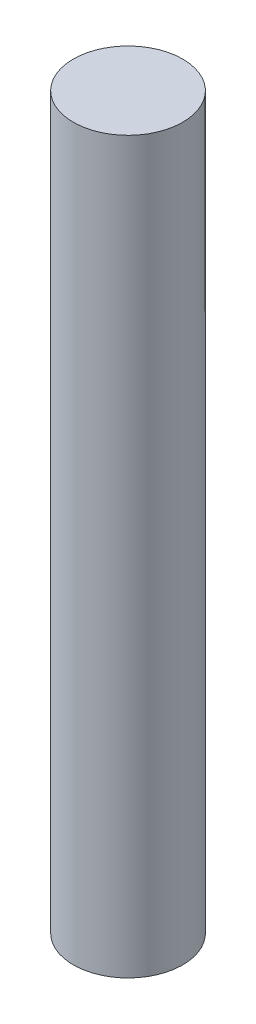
from build123d import *

# Parameters (mm, degrees)
CROQUIS3_W = 1.5
CROQUIS3_H = 20


with BuildPart() as part:
    # Croquis3 → Revoluci_n2 (revolve)
    with BuildSketch(Plane.XY, mode=Mode.PRIVATE) as revoluci_n2_sk:
        with Locations((0.75, 10)):
            Rectangle(CROQUIS3_W, CROQUIS3_H)
    revolve(revoluci_n2_sk.sketch.rotate(Axis((0, 0, 0), (0, 1, 0)), 90), axis=Axis((0, 0, 0), (0, 1, 0)))


solid = part.part
